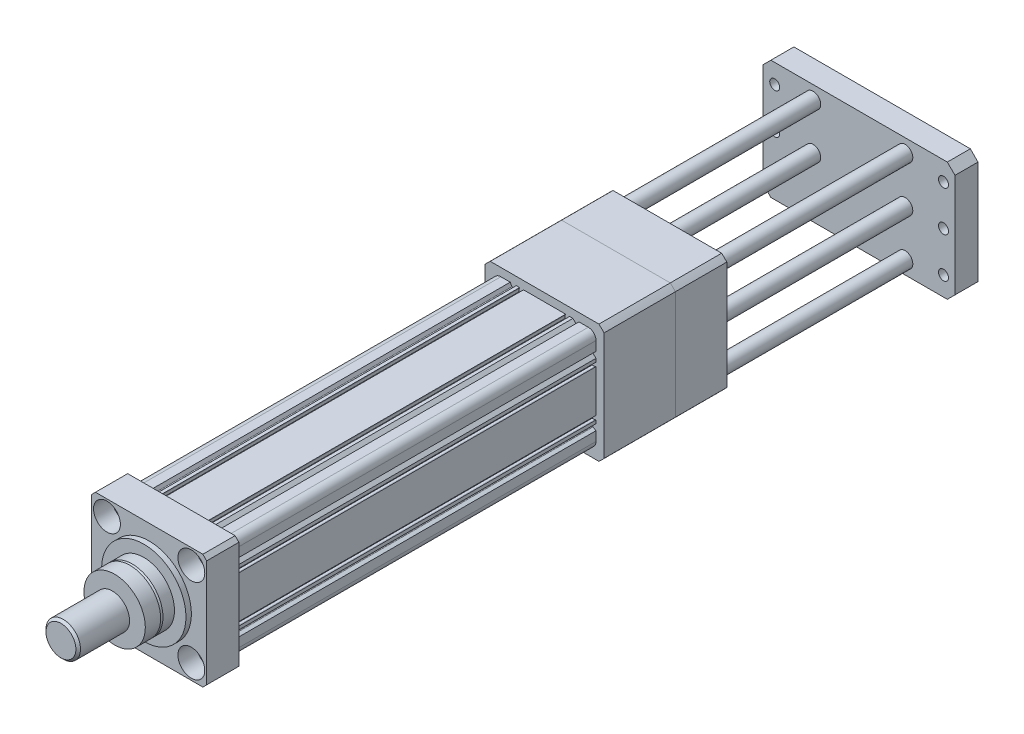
from build123d import *

# Parameters (mm, degrees)
SKETCH_1_R          = 6
EXTRUDE_1_DEPTH     = 473.5
EXTRUDE_1_2_DEPTH   = 42
SKETCH_3_R          = 6.5
SKETCH_3_R_2        = 8.5
CUT_EXTRUDE_1_DEPTH = 42
SKETCH_3_3_R        = 17.5
SKETCH_3_3_R_2      = 8.5
CUT_EXTRUDE_2_DEPTH = 24
SKETCH_3_4_R        = 55
EXTRUDE_2_DEPTH     = 7
SKETCH_4_R          = 40
EXTRUDE_3_DEPTH     = 18
CHAMFER_1_SIZE      = 3
CHAMFER_1_SIZE2     = 1.091910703
SKETCH_5_R          = 40
EXTRUDE_4_DEPTH     = 20
SKETCH_6_R          = 16.5
EXTRUDE_5_DEPTH     = 3
SKETCH_7_R          = 22.5
EXTRUDE_6_DEPTH     = 67
FILLET_1_R          = 1
CHAMFER_2_SIZE      = 3
EXTRUDE_7_DEPTH     = 93
EXTRUDE_8_DEPTH     = 67
SKETCH_10_R         = 65
CUT_EXTRUDE_3_DEPTH = 19
SKETCH_11_R         = 47
CUT_EXTRUDE_4_DEPTH = 47
SKETCH_12_R         = 65
EXTRUDE_9_DEPTH     = 1
EXTRUDE_START       = 250
SKETCH_13_W         = 250
SKETCH_13_H         = 155
SKETCH_13_R         = 6.5
EXTRUDE_10_DEPTH    = 30
SKETCH_14_R         = 10
EXTRUDE_11_DEPTH    = 250
CHAMFER_3_SIZE      = 10


with BuildPart() as part:
    # Sketch 1 → Extrude 1 (new body)
    with BuildSketch(Plane.XY):
        with BuildLine():
            Line((57, 67), (44.8, 67))
            Line((44.8, 67), (42.56486134, 63.12862628))
            ThreePointArc((42.56486134, 63.12862628), (41.829362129, 62.637181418), (40.991729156, 62.921519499))
            Line((40.991729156, 62.921519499), (36.913248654, 67))
            Line((36.913248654, 67), (32.6, 67))
            Line((32.6, 67), (32.6, 66.1))
            Line((32.6, 66.1), (33.2, 65.5))
            Line((33.2, 65.5), (33.2, 62))
            Line((33.2, 62), (26.9, 62))
            Line((26.9, 62), (26.9, 65.5))
            Line((26.9, 65.5), (27.5, 66.1))
            Line((27.5, 66.1), (27.5, 67))
            Line((27.5, 67), (0, 67))
            Line((0, 67), (-27.5, 67))
            Line((-27.5, 67), (-27.5, 66.1))
            Line((-27.5, 66.1), (-26.9, 65.5))
            Line((-26.9, 65.5), (-26.9, 62))
            Line((-26.9, 62), (-33.2, 62))
            Line((-33.2, 62), (-33.2, 65.5))
            Line((-33.2, 65.5), (-32.6, 66.1))
            Line((-32.6, 66.1), (-32.6, 67))
            Line((-32.6, 67), (-36.913248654, 67))
            Line((-36.913248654, 67), (-40.991729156, 62.921519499))
            ThreePointArc((-40.991729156, 62.921519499), (-41.829362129, 62.637181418), (-42.56486134, 63.12862628))
            Line((-42.56486134, 63.12862628), (-44.8, 67))
            Line((-44.8, 67), (-57, 67))
            ThreePointArc((-57, 67), (-64.071067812, 64.071067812), (-67, 57))
            Line((-67, 57), (-67, 44.8))
            Line((-67, 44.8), (-63.12862628, 42.56486134))
            ThreePointArc((-63.12862628, 42.56486134), (-62.637181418, 41.829362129), (-62.921519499, 40.991729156))
            Line((-62.921519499, 40.991729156), (-67, 36.913248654))
            Line((-67, 36.913248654), (-67, 32.6))
            Line((-67, 32.6), (-66.1, 32.6))
            Line((-66.1, 32.6), (-65.5, 33.2))
            Line((-65.5, 33.2), (-62, 33.2))
            Line((-62, 33.2), (-62, 26.9))
            Line((-62, 26.9), (-65.5, 26.9))
            Line((-65.5, 26.9), (-66.1, 27.5))
            Line((-66.1, 27.5), (-67, 27.5))
            Line((-67, 27.5), (-67, 0))
            Line((-67, 0), (-67, -27.5))
            Line((-67, -27.5), (-66.1, -27.5))
            Line((-66.1, -27.5), (-65.5, -26.9))
            Line((-65.5, -26.9), (-62, -26.9))
            Line((-62, -26.9), (-62, -33.2))
            Line((-62, -33.2), (-65.5, -33.2))
            Line((-65.5, -33.2), (-66.1, -32.6))
            Line((-66.1, -32.6), (-67, -32.6))
            Line((-67, -32.6), (-67, -36.913248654))
            Line((-67, -36.913248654), (-62.921519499, -40.991729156))
            ThreePointArc((-62.921519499, -40.991729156), (-62.637181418, -41.829362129), (-63.12862628, -42.56486134))
            Line((-63.12862628, -42.56486134), (-67, -44.8))
            Line((-67, -44.8), (-67, -57))
            ThreePointArc((-67, -57), (-64.071067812, -64.071067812), (-57, -67))
            Line((-57, -67), (-44.8, -67))
            Line((-44.8, -67), (-42.56486134, -63.12862628))
            ThreePointArc((-42.56486134, -63.12862628), (-41.829362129, -62.637181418), (-40.991729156, -62.921519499))
            Line((-40.991729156, -62.921519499), (-36.913248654, -67))
            Line((-36.913248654, -67), (36.913248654, -67))
            Line((36.913248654, -67), (40.991729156, -62.921519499))
            ThreePointArc((40.991729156, -62.921519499), (41.829362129, -62.637181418), (42.56486134, -63.12862628))
            Line((42.56486134, -63.12862628), (44.8, -67))
            Line((44.8, -67), (57, -67))
            ThreePointArc((57, -67), (64.071067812, -64.071067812), (67, -57))
            Line((67, -57), (67, -44.8))
            Line((67, -44.8), (63.12862628, -42.56486134))
            ThreePointArc((63.12862628, -42.56486134), (62.637181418, -41.829362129), (62.921519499, -40.991729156))
            Line((62.921519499, -40.991729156), (67, -36.913248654))
            Line((67, -36.913248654), (67, -32.6))
            Line((67, -32.6), (66.1, -32.6))
            Line((66.1, -32.6), (65.5, -33.2))
            Line((65.5, -33.2), (62, -33.2))
            Line((62, -33.2), (62, -26.9))
            Line((62, -26.9), (65.5, -26.9))
            Line((65.5, -26.9), (66.1, -27.5))
            Line((66.1, -27.5), (67, -27.5))
            Line((67, -27.5), (67, 0))
            Line((67, 0), (67, 27.5))
            Line((67, 27.5), (66.1, 27.5))
            Line((66.1, 27.5), (65.5, 26.9))
            Line((65.5, 26.9), (62, 26.9))
            Line((62, 26.9), (62, 33.2))
            Line((62, 33.2), (65.5, 33.2))
            Line((65.5, 33.2), (66.1, 32.6))
            Line((66.1, 32.6), (67, 32.6))
            Line((67, 32.6), (67, 36.913248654))
            Line((67, 36.913248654), (62.921519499, 40.991729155))
            ThreePointArc((62.921519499, 40.991729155), (62.637181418, 41.829362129), (63.12862628, 42.56486134))
            Line((63.12862628, 42.56486134), (67, 44.8))
            Line((67, 44.8), (67, 57))
            ThreePointArc((67, 57), (64.071067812, 64.071067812), (57, 67))
        make_face()
        with Locations((-55, 55)):
            Circle(SKETCH_1_R, mode=Mode.SUBTRACT)
        with Locations((55, 55)):
            Circle(SKETCH_1_R, mode=Mode.SUBTRACT)
        with Locations((-55, -55)):
            Circle(SKETCH_1_R, mode=Mode.SUBTRACT)
        with Locations((55, -55)):
            Circle(SKETCH_1_R, mode=Mode.SUBTRACT)
        with BuildLine():
            Line((41.774779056, 51.785063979), (43.601329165, 54.94874157))
            ThreePointArc((43.601329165, 54.94874157), (43.701229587, 55.707560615), (43.235303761, 56.314766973))
            Line((43.235303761, 56.314766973), (39.616756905, 58.403935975))
            ThreePointArc((39.616756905, 58.403935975), (39.337726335, 58.513191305), (39.038853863, 58.534871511))
            Line((39.038853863, 58.534871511), (35.747329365, 58.277670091))
            ThreePointArc((35.747329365, 58.277670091), (35.481311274, 58.1068038), (35.28193171, 57.86142918))
            Line((35.28193171, 57.86142918), (34.274000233, 56.115640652))
            ThreePointArc((34.274000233, 56.115640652), (34.174099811, 55.356821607), (34.640025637, 54.749615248))
            Line((34.640025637, 54.749615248), (40.408753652, 51.419038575))
            ThreePointArc((40.408753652, 51.419038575), (41.167572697, 51.319138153), (41.774779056, 51.785063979))
        make_face(mode=Mode.SUBTRACT)
        with BuildLine():
            Line((51.785063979, 41.774779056), (54.94874157, 43.601329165))
            ThreePointArc((54.94874157, 43.601329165), (55.707560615, 43.701229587), (56.314766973, 43.235303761))
            Line((56.314766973, 43.235303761), (58.403935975, 39.616756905))
            ThreePointArc((58.403935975, 39.616756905), (58.513191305, 39.337726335), (58.534871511, 39.038853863))
            Line((58.534871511, 39.038853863), (58.277670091, 35.747329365))
            ThreePointArc((58.277670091, 35.747329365), (58.1068038, 35.481311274), (57.86142918, 35.28193171))
            Line((57.86142918, 35.28193171), (56.115640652, 34.274000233))
            ThreePointArc((56.115640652, 34.274000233), (55.356821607, 34.174099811), (54.749615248, 34.640025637))
            Line((54.749615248, 34.640025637), (51.419038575, 40.408753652))
            ThreePointArc((51.419038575, 40.408753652), (51.319138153, 41.167572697), (51.785063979, 41.774779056))
        make_face(mode=Mode.SUBTRACT)
        with BuildLine():
            Line((-57.86142918, 35.28193171), (-56.115640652, 34.274000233))
            ThreePointArc((-56.115640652, 34.274000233), (-55.356821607, 34.174099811), (-54.749615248, 34.640025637))
            Line((-54.749615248, 34.640025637), (-51.419038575, 40.408753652))
            ThreePointArc((-51.419038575, 40.408753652), (-51.319138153, 41.167572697), (-51.785063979, 41.774779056))
            Line((-51.785063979, 41.774779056), (-54.94874157, 43.601329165))
            ThreePointArc((-54.94874157, 43.601329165), (-55.707560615, 43.701229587), (-56.314766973, 43.235303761))
            Line((-56.314766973, 43.235303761), (-58.403935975, 39.616756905))
            ThreePointArc((-58.403935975, 39.616756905), (-58.513191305, 39.337726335), (-58.534871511, 39.038853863))
            Line((-58.534871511, 39.038853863), (-58.277670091, 35.747329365))
            ThreePointArc((-58.277670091, 35.747329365), (-58.1068038, 35.481311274), (-57.86142918, 35.28193171))
        make_face(mode=Mode.SUBTRACT)
        with BuildLine():
            Line((-33.360371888, -64.600232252), (-19.423193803, -64.600232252))
            ThreePointArc((-19.423193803, -64.600232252), (-18.434155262, -63.747889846), (-19.1311157, -62.643837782))
            ThreePointArc((-19.1311157, -62.643837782), (-26.690004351, -59.815496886), (-33.843674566, -56.079012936))
            ThreePointArc((-33.843674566, -56.079012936), (-34.851952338, -56.064348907), (-35.360371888, -56.935181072))
            Line((-35.360371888, -56.935181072), (-35.360371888, -62.600232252))
            Line((-35.360371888, -62.600232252), (-33.360371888, -64.600232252))
        make_face(mode=Mode.SUBTRACT)
        with BuildLine():
            Line((35.360371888, -62.600232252), (33.360371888, -64.600232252))
            Line((33.360371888, -64.600232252), (19.423193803, -64.600232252))
            ThreePointArc((19.423193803, -64.600232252), (18.434155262, -63.747889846), (19.1311157, -62.643837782))
            ThreePointArc((19.1311157, -62.643837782), (26.690004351, -59.815496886), (33.843674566, -56.079012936))
            ThreePointArc((33.843674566, -56.079012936), (34.851952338, -56.064348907), (35.360371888, -56.935181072))
            Line((35.360371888, -56.935181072), (35.360371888, -62.600232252))
        make_face(mode=Mode.SUBTRACT)
        with BuildLine():
            Line((51.785063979, -41.774779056), (54.94874157, -43.601329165))
            ThreePointArc((54.94874157, -43.601329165), (55.707560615, -43.701229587), (56.314766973, -43.235303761))
            Line((56.314766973, -43.235303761), (58.403935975, -39.616756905))
            ThreePointArc((58.403935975, -39.616756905), (58.513191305, -39.337726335), (58.534871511, -39.038853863))
            Line((58.534871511, -39.038853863), (58.277670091, -35.747329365))
            ThreePointArc((58.277670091, -35.747329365), (58.1068038, -35.481311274), (57.86142918, -35.28193171))
            Line((57.86142918, -35.28193171), (56.115640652, -34.274000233))
            ThreePointArc((56.115640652, -34.274000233), (55.356821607, -34.174099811), (54.749615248, -34.640025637))
            Line((54.749615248, -34.640025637), (51.419038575, -40.408753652))
            ThreePointArc((51.419038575, -40.408753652), (51.319138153, -41.167572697), (51.785063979, -41.774779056))
        make_face(mode=Mode.SUBTRACT)
        with BuildLine():
            Line((-57.86142918, -35.28193171), (-56.115640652, -34.274000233))
            ThreePointArc((-56.115640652, -34.274000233), (-55.356821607, -34.174099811), (-54.749615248, -34.640025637))
            Line((-54.749615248, -34.640025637), (-51.419038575, -40.408753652))
            ThreePointArc((-51.419038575, -40.408753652), (-51.319138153, -41.167572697), (-51.785063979, -41.774779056))
            Line((-51.785063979, -41.774779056), (-54.94874157, -43.601329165))
            ThreePointArc((-54.94874157, -43.601329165), (-55.707560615, -43.701229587), (-56.314766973, -43.235303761))
            Line((-56.314766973, -43.235303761), (-58.403935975, -39.616756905))
            ThreePointArc((-58.403935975, -39.616756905), (-58.513191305, -39.337726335), (-58.534871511, -39.038853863))
            Line((-58.534871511, -39.038853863), (-58.277670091, -35.747329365))
            ThreePointArc((-58.277670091, -35.747329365), (-58.1068038, -35.481311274), (-57.86142918, -35.28193171))
        make_face(mode=Mode.SUBTRACT)
        with BuildLine():
            Line((-41.774779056, 51.785063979), (-43.601329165, 54.94874157))
            ThreePointArc((-43.601329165, 54.94874157), (-43.701229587, 55.707560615), (-43.235303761, 56.314766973))
            Line((-43.235303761, 56.314766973), (-39.616756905, 58.403935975))
            ThreePointArc((-39.616756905, 58.403935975), (-39.337726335, 58.513191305), (-39.038853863, 58.534871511))
            Line((-39.038853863, 58.534871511), (-35.747329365, 58.277670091))
            ThreePointArc((-35.747329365, 58.277670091), (-35.481311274, 58.1068038), (-35.28193171, 57.86142918))
            Line((-35.28193171, 57.86142918), (-34.274000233, 56.115640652))
            ThreePointArc((-34.274000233, 56.115640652), (-34.174099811, 55.356821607), (-34.640025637, 54.749615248))
            Line((-34.640025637, 54.749615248), (-40.408753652, 51.419038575))
            ThreePointArc((-40.408753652, 51.419038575), (-41.167572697, 51.319138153), (-41.774779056, 51.785063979))
        make_face(mode=Mode.SUBTRACT)
        with BuildLine():
            ThreePointArc((62.5, 0), (0, 62.5), (-62.5, 0))
            ThreePointArc((-62.5, 0), (0, -62.5), (62.5, 0))
        make_face(mode=Mode.SUBTRACT)
    extrude(amount=EXTRUDE_1_DEPTH)

    # Sketch 2 → Extrude 1 2 (add)
    with BuildSketch(Plane.XY.offset(473.5)):
        Polygon((-75, 70), (-70, 75), (70, 75), (75, 70), (75, -70), (70, -75), (-70, -75), (-75, -70), align=None)
    extrude(amount=EXTRUDE_1_2_DEPTH)

    # Sketch 3 → Cut-Extrude 1 (cut)
    with BuildSketch(Plane.XY.offset(515.5)):
        with Locations((-85, 20)):
            Circle(SKETCH_3_R)
        with Locations((-85, -20)):
            Circle(SKETCH_3_R)
        with Locations((-85, -60)):
            Circle(SKETCH_3_R)
        with Locations((-55, -55)):
            Circle(SKETCH_3_R_2)
        with Locations((-55, 55)):
            Circle(SKETCH_3_R_2)
        with Locations((55, 55)):
            Circle(SKETCH_3_R_2)
        with Locations((85, 60)):
            Circle(SKETCH_3_R)
        with Locations((85, 20)):
            Circle(SKETCH_3_R)
        with Locations((85, -20)):
            Circle(SKETCH_3_R)
        with Locations((85, -60)):
            Circle(SKETCH_3_R)
        with Locations((55, -55)):
            Circle(SKETCH_3_R_2)
        with Locations((-85, 60)):
            Circle(SKETCH_3_R)
    extrude(amount=-CUT_EXTRUDE_1_DEPTH, mode=Mode.SUBTRACT)

    # Sketch 3_3 → Cut-Extrude 2 (cut)
    # profile 1 of 4: a face of its own
    with BuildSketch(Plane.XY.offset(515.5)):
        with Locations((55, 55)):
            Circle(SKETCH_3_3_R)
        with Locations((55, 55)):
            Circle(SKETCH_3_3_R_2, mode=Mode.SUBTRACT)
    # profile 2 of 4: a face of its own
    with BuildSketch(Plane.XY.offset(515.5)):
        with Locations((55, -55)):
            Circle(SKETCH_3_3_R)
        with Locations((55, -55)):
            Circle(SKETCH_3_3_R_2, mode=Mode.SUBTRACT)
    # profile 3 of 4: a face of its own
    with BuildSketch(Plane.XY.offset(515.5)):
        with Locations((-55, -55)):
            Circle(SKETCH_3_3_R)
        with Locations((-55, -55)):
            Circle(SKETCH_3_3_R_2, mode=Mode.SUBTRACT)
    # profile 4 of 4: a face of its own
    with BuildSketch(Plane.XY.offset(515.5)):
        with Locations((-55, 55)):
            Circle(SKETCH_3_3_R)
    extrude(amount=-CUT_EXTRUDE_2_DEPTH, mode=Mode.SUBTRACT)

    # Sketch 3_4 → Extrude 2 (add)
    with BuildSketch(Plane.XY.offset(515.5)):
        with Locations(Location((0, 0, 0), (0, 0, 180))):
            Circle(SKETCH_3_4_R)
    extrude(amount=EXTRUDE_2_DEPTH)

    # Sketch 4 → Extrude 3 (add)
    with BuildSketch(Plane.XY.offset(522.5)):
        Circle(SKETCH_4_R)
    extrude(amount=EXTRUDE_3_DEPTH)

    # Chamfer 1
    chamfer_1_edges = [part.edges().sort_by_distance(p)[0] for p in [
        (-40, 0, 540.5),
    ]]
    chamfer_1_side = [part.faces().sort_by_distance(p)[0] for p in [
        (-40, 0, 531.5),
    ]]
    chamfer(chamfer_1_edges, length=CHAMFER_1_SIZE, length2=CHAMFER_1_SIZE2, reference=chamfer_1_side[0])

    # Sketch 5 → Extrude 4 (add)
    with BuildSketch(Plane.XY.offset(540.5)):
        Circle(SKETCH_5_R)
    extrude(amount=EXTRUDE_4_DEPTH)

    # Sketch 6 → Extrude 5 (add)
    with BuildSketch(Plane.XY.offset(560.5)):
        Circle(SKETCH_6_R)
    extrude(amount=EXTRUDE_5_DEPTH)

    # Sketch 7 → Extrude 6 (add)
    with BuildSketch(Plane.XY.offset(563.5)):
        Circle(SKETCH_7_R)
    extrude(amount=EXTRUDE_6_DEPTH)

    # Fillet 1
    fillet_1_edges = [part.edges().sort_by_distance(p)[0] for p in [
        (-16.5, 0, 560.5),
    ]]
    fillet(fillet_1_edges, radius=FILLET_1_R)

    # Chamfer 2
    chamfer_2_edges = [part.edges().sort_by_distance(p)[0] for p in [
        (-22.5, 0, 630.5),
    ]]
    chamfer(chamfer_2_edges, length=CHAMFER_2_SIZE)

    # Sketch 8 → Extrude 7 (add)
    with BuildSketch(Plane(origin=(0, 0, 0), x_dir=(-1, 0, 0), z_dir=(0, 0, -1))):
        with BuildLine():
            Line((-70.843136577, 77.5), (70.843136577, 77.5))
            ThreePointArc((70.843136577, 77.5), (74.246212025, 74.246212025), (77.5, 70.843136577))
            Line((77.5, 70.843136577), (77.5, -70.843136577))
            ThreePointArc((77.5, -70.843136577), (74.246212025, -74.246212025), (70.843136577, -77.5))
            Line((70.843136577, -77.5), (-70.843136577, -77.5))
            ThreePointArc((-70.843136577, -77.5), (-74.246212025, -74.246212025), (-77.5, -70.843136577))
            Line((-77.5, -70.843136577), (-77.5, 70.843136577))
            ThreePointArc((-77.5, 70.843136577), (-74.246212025, 74.246212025), (-70.843136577, 77.5))
        make_face()
    extrude(amount=EXTRUDE_7_DEPTH)


with BuildPart() as body_2:
    # Sketch 9 → Extrude 8 (new body)
    with BuildSketch(Plane(origin=(0, 0, -93), x_dir=(-1, 0, 0), z_dir=(0, 0, -1))):
        with BuildLine():
            Line((-70.843136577, 77.5), (70.843136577, 77.5))
            ThreePointArc((70.843136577, 77.5), (74.246212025, 74.246212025), (77.5, 70.843136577))
            Line((77.5, 70.843136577), (77.5, -70.843136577))
            ThreePointArc((77.5, -70.843136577), (74.246212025, -74.246212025), (70.843136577, -77.5))
            Line((70.843136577, -77.5), (-70.843136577, -77.5))
            ThreePointArc((-70.843136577, -77.5), (-74.246212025, -74.246212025), (-77.5, -70.843136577))
            Line((-77.5, -70.843136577), (-77.5, 70.843136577))
            ThreePointArc((-77.5, 70.843136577), (-74.246212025, 74.246212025), (-70.843136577, 77.5))
        make_face()
    extrude(amount=EXTRUDE_8_DEPTH)

    # Sketch 10 → Cut-Extrude 3 (cut)
    with BuildSketch(Plane(origin=(0, 0, -160), x_dir=(-1, 0, 0), z_dir=(0, 0, -1))):
        Circle(SKETCH_10_R)
    extrude(amount=-CUT_EXTRUDE_3_DEPTH, mode=Mode.SUBTRACT)

    # Sketch 11 → Cut-Extrude 4 (cut)
    with BuildSketch(Plane(origin=(0, 0, -141), x_dir=(-1, 0, 0), z_dir=(0, 0, -1))):
        Circle(SKETCH_11_R)
    extrude(amount=-CUT_EXTRUDE_4_DEPTH, mode=Mode.SUBTRACT)

    # Sketch 12 → Extrude 9 (add)
    with BuildSketch(Plane(origin=(0, 0, -160), x_dir=(-1, 0, 0), z_dir=(0, 0, -1))):
        Circle(SKETCH_12_R)
    extrude(amount=-EXTRUDE_9_DEPTH)

    # Sketch 14 → Extrude 11 (add)
    with BuildSketch(Plane(origin=(0, 0, -160), x_dir=(-1, 0, 0), z_dir=(0, 0, -1))):
        with Locations((60, 60)):
            Circle(SKETCH_14_R)
        with Locations((60, -60)):
            Circle(SKETCH_14_R)
        with Locations(Location((-60, -60, 0), (0, 0, 180))):
            Circle(SKETCH_14_R)
        with Locations(Location((-60, 60, 0), (0, 0, 180))):
            Circle(SKETCH_14_R)
        with Locations((-60, 0)):
            Circle(SKETCH_14_R)
        with Locations((60, 0)):
            Circle(SKETCH_14_R)
    extrude(amount=EXTRUDE_11_DEPTH)


with BuildPart() as body_3:
    # Sketch 13 → Extrude 10 (new body)
    with BuildSketch(Plane(origin=(0, 0, -160), x_dir=(-1, 0, 0), z_dir=(0, 0, -1)).offset(EXTRUDE_START)):
        Rectangle(SKETCH_13_W, SKETCH_13_H)
        with Locations((-110, 52.5)):
            Circle(SKETCH_13_R, mode=Mode.SUBTRACT)
        with Locations((-110, -52.5)):
            Circle(SKETCH_13_R, mode=Mode.SUBTRACT)
        with Locations((-110, 0)):
            Circle(SKETCH_13_R, mode=Mode.SUBTRACT)
        with Locations(Location((110, -52.5, 0), (0, 0, 180))):
            Circle(SKETCH_13_R, mode=Mode.SUBTRACT)
        with Locations(Location((110, 0, 0), (0, 0, 180))):
            Circle(SKETCH_13_R, mode=Mode.SUBTRACT)
        with Locations(Location((110, 52.5, 0), (0, 0, 180))):
            Circle(SKETCH_13_R, mode=Mode.SUBTRACT)
    extrude(amount=EXTRUDE_10_DEPTH)

    # Chamfer 3
    chamfer_3_edges = [body_3.edges().sort_by_distance(p)[0] for p in [
        (-125, -77.5, -425),
        (125, -77.5, -425),
        (125, 77.5, -425),
        (-125, 77.5, -425),
    ]]
    chamfer(chamfer_3_edges, length=CHAMFER_3_SIZE)


solid = Compound([part.part, body_2.part, body_3.part])
